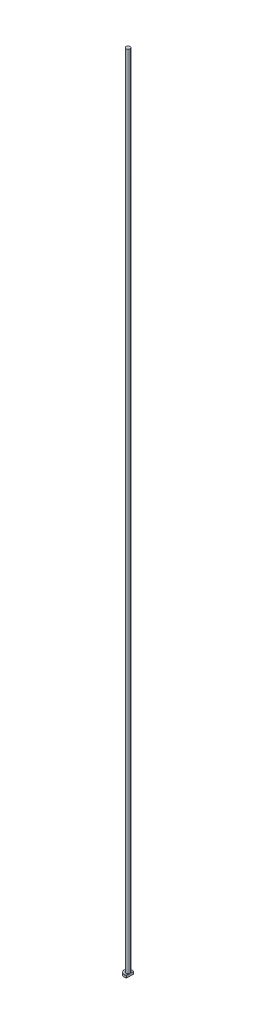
ISO-10303-21;
HEADER;
FILE_DESCRIPTION(('STEP AP214'),'2;1');
FILE_NAME('part.step','',(''),(''),'','','');
FILE_SCHEMA(('AUTOMOTIVE_DESIGN { 1 0 10303 214 1 1 1 1 }'));
ENDSEC;
DATA;
#1=APPLICATION_CONTEXT('core data for automotive mechanical design processes');
#2=APPLICATION_PROTOCOL_DEFINITION('international standard','automotive_design',2000,#1);
#3=PRODUCT_CONTEXT('',#1,'mechanical');
#4=PRODUCT('Part','Part','',(#3));
#5=PRODUCT_RELATED_PRODUCT_CATEGORY('part','',(#4));
#6=PRODUCT_DEFINITION_FORMATION('','',#4);
#7=PRODUCT_DEFINITION_CONTEXT('part definition',#1,'design');
#8=PRODUCT_DEFINITION('design','',#6,#7);
#9=PRODUCT_DEFINITION_SHAPE('','',#8);
#10=(LENGTH_UNIT() NAMED_UNIT(*) SI_UNIT(.MILLI.,.METRE.));
#11=(NAMED_UNIT(*) PLANE_ANGLE_UNIT() SI_UNIT($,.RADIAN.));
#12=(NAMED_UNIT(*) SI_UNIT($,.STERADIAN.) SOLID_ANGLE_UNIT());
#13=UNCERTAINTY_MEASURE_WITH_UNIT(LENGTH_MEASURE(1.E-05),#10,'distance_accuracy_value','');
#14=(GEOMETRIC_REPRESENTATION_CONTEXT(3) GLOBAL_UNCERTAINTY_ASSIGNED_CONTEXT((#13)) GLOBAL_UNIT_ASSIGNED_CONTEXT((#10,
#11,#12)) REPRESENTATION_CONTEXT('',''));
#15=CARTESIAN_POINT('',(0.,0.,0.));
#16=DIRECTION('',(0.,0.,1.));
#17=DIRECTION('',(1.,0.,0.));
#18=AXIS2_PLACEMENT_3D('',#15,#16,#17);
#19=CARTESIAN_POINT('',(0.,0.,0.));
#20=DIRECTION('',(0.,-1.,0.));
#21=DIRECTION('',(0.,0.,-1.));
#22=AXIS2_PLACEMENT_3D('',#19,#20,#21);
#23=PLANE('',#22);
#24=CARTESIAN_POINT('',(0.,0.,0.));
#25=DIRECTION('',(0.,-1.,0.));
#26=DIRECTION('',(0.,0.,-1.));
#27=AXIS2_PLACEMENT_3D('',#24,#25,#26);
#28=CIRCLE('',#27,4.7999999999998);
#29=CARTESIAN_POINT('',(2.49999999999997,0.,4.09756024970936));
#30=VERTEX_POINT('',#29);
#31=CARTESIAN_POINT('',(2.49999999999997,0.,-4.09756024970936));
#32=VERTEX_POINT('',#31);
#33=EDGE_CURVE('E98',#30,#32,#28,.T.);
#34=ORIENTED_EDGE('',*,*,#33,.T.);
#35=DIRECTION('',(0.,0.,1.));
#36=VECTOR('',#35,1.);
#37=CARTESIAN_POINT('',(2.49999999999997,0.,-4.33012701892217));
#38=LINE('',#37,#36);
#39=EDGE_CURVE('E83',#32,#30,#38,.T.);
#40=ORIENTED_EDGE('',*,*,#39,.T.);
#41=EDGE_LOOP('',(#34,#40));
#42=FACE_BOUND('',#41,.T.);
#43=ADVANCED_FACE('F32',(#42),#23,.T.);
#44=CARTESIAN_POINT('',(0.,259.958771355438,0.));
#45=DIRECTION('',(0.,1.,0.));
#46=DIRECTION('',(0.,0.,1.));
#47=AXIS2_PLACEMENT_3D('',#44,#45,#46);
#48=CYLINDRICAL_SURFACE('',#47,4.99999999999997);
#49=CARTESIAN_POINT('',(0.,2.80000000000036,0.));
#50=DIRECTION('',(0.,1.,0.));
#51=DIRECTION('',(0.,0.,1.));
#52=AXIS2_PLACEMENT_3D('',#49,#50,#51);
#53=CIRCLE('',#52,4.99999999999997);
#54=CARTESIAN_POINT('',(2.49999999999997,2.80000000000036,4.33012701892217));
#55=VERTEX_POINT('',#54);
#56=CARTESIAN_POINT('',(2.49999999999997,2.80000000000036,-4.33012701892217));
#57=VERTEX_POINT('',#56);
#58=EDGE_CURVE('E104',#55,#57,#53,.F.);
#59=ORIENTED_EDGE('',*,*,#58,.T.);
#60=DIRECTION('',(0.,-1.,0.));
#61=VECTOR('',#60,1.);
#62=CARTESIAN_POINT('',(2.49999999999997,1000.,-4.33012701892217));
#63=LINE('',#62,#61);
#64=CARTESIAN_POINT('',(2.49999999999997,0.200000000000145,-4.33012701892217));
#65=VERTEX_POINT('',#64);
#66=EDGE_CURVE('E183',#57,#65,#63,.T.);
#67=ORIENTED_EDGE('',*,*,#66,.T.);
#68=CARTESIAN_POINT('',(0.,0.200000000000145,0.));
#69=DIRECTION('',(0.,-1.,0.));
#70=DIRECTION('',(0.,0.,-1.));
#71=AXIS2_PLACEMENT_3D('',#68,#69,#70);
#72=CIRCLE('',#71,4.99999999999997);
#73=CARTESIAN_POINT('',(2.49999999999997,0.200000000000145,4.33012701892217));
#74=VERTEX_POINT('',#73);
#75=EDGE_CURVE('E100',#65,#74,#72,.F.);
#76=ORIENTED_EDGE('',*,*,#75,.T.);
#77=DIRECTION('',(0.,-1.,0.));
#78=VECTOR('',#77,1.);
#79=CARTESIAN_POINT('',(2.49999999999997,1000.,4.33012701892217));
#80=LINE('',#79,#78);
#81=EDGE_CURVE('E93',#55,#74,#80,.T.);
#82=ORIENTED_EDGE('',*,*,#81,.F.);
#83=EDGE_LOOP('',(#59,#67,#76,#82));
#84=FACE_BOUND('',#83,.T.);
#85=ADVANCED_FACE('F158',(#84),#48,.T.);
#86=CARTESIAN_POINT('',(-4.99999999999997,3.,0.));
#87=DIRECTION('',(0.,1.,0.));
#88=DIRECTION('',(0.,0.,1.));
#89=AXIS2_PLACEMENT_3D('',#86,#87,#88);
#90=PLANE('',#89);
#91=CARTESIAN_POINT('',(0.,3.,0.));
#92=DIRECTION('',(0.,1.,0.));
#93=DIRECTION('',(0.,0.,1.));
#94=AXIS2_PLACEMENT_3D('',#91,#92,#93);
#95=CIRCLE('',#94,4.80000000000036);
#96=CARTESIAN_POINT('',(2.49999999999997,3.,-4.09756024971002));
#97=VERTEX_POINT('',#96);
#98=CARTESIAN_POINT('',(2.49999999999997,3.,4.09756024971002));
#99=VERTEX_POINT('',#98);
#100=EDGE_CURVE('E178',#97,#99,#95,.T.);
#101=ORIENTED_EDGE('',*,*,#100,.T.);
#102=DIRECTION('',(0.,0.,-1.));
#103=VECTOR('',#102,1.);
#104=CARTESIAN_POINT('',(2.49999999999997,3.,0.));
#105=LINE('',#104,#103);
#106=CARTESIAN_POINT('',(2.49999999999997,2.99999999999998,1.01980390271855));
#107=VERTEX_POINT('',#106);
#108=EDGE_CURVE('E57',#99,#107,#105,.T.);
#109=ORIENTED_EDGE('',*,*,#108,.T.);
#110=CARTESIAN_POINT('',(0.,3.,0.));
#111=DIRECTION('',(0.,1.,0.));
#112=DIRECTION('',(0.,0.,1.));
#113=AXIS2_PLACEMENT_3D('',#110,#111,#112);
#114=CIRCLE('',#113,2.69999999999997);
#115=CARTESIAN_POINT('',(2.49999999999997,2.99999999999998,-1.01980390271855));
#116=VERTEX_POINT('',#115);
#117=EDGE_CURVE('E107',#107,#116,#114,.F.);
#118=ORIENTED_EDGE('',*,*,#117,.T.);
#119=EDGE_CURVE('E136',#116,#97,#105,.T.);
#120=ORIENTED_EDGE('',*,*,#119,.T.);
#121=EDGE_LOOP('',(#101,#109,#118,#120));
#122=FACE_BOUND('',#121,.T.);
#123=ADVANCED_FACE('F147',(#122),#90,.T.);
#124=CARTESIAN_POINT('',(0.,3.,0.));
#125=DIRECTION('',(0.,-1.,0.));
#126=DIRECTION('',(0.,0.,-1.));
#127=AXIS2_PLACEMENT_3D('',#124,#125,#126);
#128=CONICAL_SURFACE('',#127,4.80000000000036,0.785398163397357);
#129=ORIENTED_EDGE('',*,*,#58,.F.);
#130=CARTESIAN_POINT('',(2.49999999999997,-2.05039133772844,9.527864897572));
#131=CARTESIAN_POINT('',(2.49999999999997,-1.84160367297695,9.31199733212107));
#132=CARTESIAN_POINT('',(2.49999999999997,-1.63304008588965,9.0959123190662));
#133=CARTESIAN_POINT('',(2.49999999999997,-1.21649358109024,8.66317810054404));
#134=CARTESIAN_POINT('',(2.49999999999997,-1.00851067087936,8.44652888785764));
#135=CARTESIAN_POINT('',(2.49999999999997,-0.593157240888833,8.01243155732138));
#136=CARTESIAN_POINT('',(2.49999999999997,-0.385787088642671,7.79498308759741));
#137=CARTESIAN_POINT('',(2.49999999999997,0.0280365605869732,7.35921771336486));
#138=CARTESIAN_POINT('',(2.49999999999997,0.23449006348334,7.1409008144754));
#139=CARTESIAN_POINT('',(2.49999999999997,0.642130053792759,6.70748960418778));
#140=CARTESIAN_POINT('',(2.49999999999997,0.843339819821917,6.49241720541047));
#141=CARTESIAN_POINT('',(2.49999999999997,1.24425381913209,6.06087422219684));
#142=CARTESIAN_POINT('',(2.49999999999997,1.44395806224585,5.84440364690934));
#143=CARTESIAN_POINT('',(2.49999999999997,1.841277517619,5.4096366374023));
#144=CARTESIAN_POINT('',(2.49999999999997,2.03889317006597,5.1913406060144));
#145=CARTESIAN_POINT('',(2.49999999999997,2.43125043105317,4.75218509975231));
#146=CARTESIAN_POINT('',(2.49999999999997,2.62599215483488,4.53132572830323));
#147=CARTESIAN_POINT('',(2.49999999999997,2.93693788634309,4.17181619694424));
#148=CARTESIAN_POINT('',(2.49999999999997,3.05446493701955,4.0343118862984));
#149=CARTESIAN_POINT('',(2.49999999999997,3.2874270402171,3.75751486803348));
#150=CARTESIAN_POINT('',(2.49999999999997,3.40286188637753,3.61822198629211));
#151=CARTESIAN_POINT('',(2.49999999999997,3.63213234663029,3.33586492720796));
#152=CARTESIAN_POINT('',(2.49999999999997,3.74593818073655,3.1927764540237));
#153=CARTESIAN_POINT('',(2.49999999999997,3.96956266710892,2.90356071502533));
#154=CARTESIAN_POINT('',(2.49999999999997,4.07938227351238,2.75743418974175));
#155=CARTESIAN_POINT('',(2.49999999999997,4.29502410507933,2.45881038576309));
#156=CARTESIAN_POINT('',(2.49999999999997,4.40076032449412,2.3062500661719));
#157=CARTESIAN_POINT('',(2.49999999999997,4.55286945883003,2.07299325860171));
#158=CARTESIAN_POINT('',(2.49999999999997,4.60252613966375,1.99444197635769));
#159=CARTESIAN_POINT('',(2.49999999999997,4.69908164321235,1.83566827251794));
#160=CARTESIAN_POINT('',(2.49999999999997,4.74598077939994,1.75544604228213));
#161=CARTESIAN_POINT('',(2.49999999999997,4.83578466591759,1.59405362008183));
#162=CARTESIAN_POINT('',(2.49999999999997,4.87873126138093,1.51290702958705));
#163=CARTESIAN_POINT('',(2.49999999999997,4.96038600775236,1.34852090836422));
#164=CARTESIAN_POINT('',(2.49999999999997,4.99909338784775,1.26528100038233));
#165=CARTESIAN_POINT('',(2.49999999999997,5.10703093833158,1.01251774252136));
#166=CARTESIAN_POINT('',(2.49999999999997,5.16843307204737,0.839342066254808));
#167=CARTESIAN_POINT('',(2.49999999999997,5.23490554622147,0.579703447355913));
#168=CARTESIAN_POINT('',(2.49999999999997,5.25253806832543,0.496421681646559));
#169=CARTESIAN_POINT('',(2.49999999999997,5.27986337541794,0.328535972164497));
#170=CARTESIAN_POINT('',(2.49999999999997,5.28955686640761,0.243932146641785));
#171=CARTESIAN_POINT('',(2.49999999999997,5.30031768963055,0.0744340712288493));
#172=CARTESIAN_POINT('',(2.49999999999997,5.30141176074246,-0.0104584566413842));
#173=CARTESIAN_POINT('',(2.49999999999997,5.294965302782,-0.179916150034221));
#174=CARTESIAN_POINT('',(2.49999999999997,5.28742406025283,-0.264481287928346));
#175=CARTESIAN_POINT('',(2.49999999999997,5.26433424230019,-0.431754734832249));
#176=CARTESIAN_POINT('',(2.49999999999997,5.24885436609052,-0.514472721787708));
#177=CARTESIAN_POINT('',(2.49999999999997,5.21085318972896,-0.678257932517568));
#178=CARTESIAN_POINT('',(2.49999999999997,5.18833104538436,-0.759324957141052));
#179=CARTESIAN_POINT('',(2.49999999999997,5.1371892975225,-0.920001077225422));
#180=CARTESIAN_POINT('',(2.49999999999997,5.1085353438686,-0.999599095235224));
#181=CARTESIAN_POINT('',(2.49999999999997,5.04628092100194,-1.15679278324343));
#182=CARTESIAN_POINT('',(2.49999999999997,5.01268146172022,-1.23438885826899));
#183=CARTESIAN_POINT('',(2.49999999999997,4.90558195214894,-1.46503672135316));
#184=CARTESIAN_POINT('',(2.49999999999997,4.82601567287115,-1.61526350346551));
#185=CARTESIAN_POINT('',(2.49999999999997,4.65635232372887,-1.90970759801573));
#186=CARTESIAN_POINT('',(2.49999999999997,4.56624199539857,-2.0539170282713));
#187=CARTESIAN_POINT('',(2.49999999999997,4.37862201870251,-2.33821627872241));
#188=CARTESIAN_POINT('',(2.49999999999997,4.28108460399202,-2.47828761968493));
#189=CARTESIAN_POINT('',(2.49999999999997,4.08116271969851,-2.75478641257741));
#190=CARTESIAN_POINT('',(2.49999999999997,3.97878070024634,-2.89121565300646));
#191=CARTESIAN_POINT('',(2.49999999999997,3.7691391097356,-3.16313520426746));
#192=CARTESIAN_POINT('',(2.49999999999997,3.66183307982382,-3.29858952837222));
#193=CARTESIAN_POINT('',(2.49999999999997,3.44456217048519,-3.56736427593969));
#194=CARTESIAN_POINT('',(2.49999999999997,3.33459700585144,-3.70068446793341));
#195=CARTESIAN_POINT('',(2.49999999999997,3.1129346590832,-3.96532340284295));
#196=CARTESIAN_POINT('',(2.49999999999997,3.00124232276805,-4.09664621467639));
#197=CARTESIAN_POINT('',(2.49999999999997,2.7763127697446,-4.35796341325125));
#198=CARTESIAN_POINT('',(2.49999999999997,2.66307552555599,-4.48795777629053));
#199=CARTESIAN_POINT('',(2.49999999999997,2.36028773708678,-4.83228553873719));
#200=CARTESIAN_POINT('',(2.49999999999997,2.16967435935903,-5.04568363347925));
#201=CARTESIAN_POINT('',(2.49999999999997,1.78611780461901,-5.4703791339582));
#202=CARTESIAN_POINT('',(2.49999999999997,1.59317456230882,-5.68167648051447));
#203=CARTESIAN_POINT('',(2.49999999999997,1.20540648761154,-6.1029035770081));
#204=CARTESIAN_POINT('',(2.49999999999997,1.01058005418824,-6.31283185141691));
#205=CARTESIAN_POINT('',(2.49999999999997,0.619649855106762,-6.73149551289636));
#206=CARTESIAN_POINT('',(2.49999999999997,0.423546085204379,-6.94023089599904));
#207=CARTESIAN_POINT('',(2.49999999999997,0.0384434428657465,-7.34820392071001));
#208=CARTESIAN_POINT('',(2.49999999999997,-0.150515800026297,-7.5474789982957));
#209=CARTESIAN_POINT('',(2.49999999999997,-0.529153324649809,-7.94534601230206));
#210=CARTESIAN_POINT('',(2.49999999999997,-0.718831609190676,-8.14393794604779));
#211=CARTESIAN_POINT('',(2.49999999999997,-1.09855461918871,-8.54034636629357));
#212=CARTESIAN_POINT('',(2.49999999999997,-1.28859869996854,-8.73816347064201));
#213=CARTESIAN_POINT('',(2.49999999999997,-1.66916268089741,-9.13333639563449));
#214=CARTESIAN_POINT('',(2.49999999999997,-1.85968257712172,-9.33069222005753));
#215=CARTESIAN_POINT('',(2.49999999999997,-2.05039133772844,-9.527864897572));
#216=B_SPLINE_CURVE_WITH_KNOTS('',3,(#130,#131,#132,#133,#134,#135,#136,#137,#138,#139,#140,
#141,#142,#143,#144,#145,#146,#147,#148,#149,#150,#151,#152,#153,#154,#155,#156,#157,#158,#159,
#160,#161,#162,#163,#164,#165,#166,#167,#168,#169,#170,#171,#172,#173,#174,#175,#176,#177,#178,
#179,#180,#181,#182,#183,#184,#185,#186,#187,#188,#189,#190,#191,#192,#193,#194,#195,#196,#197,
#198,#199,#200,#201,#202,#203,#204,#205,#206,#207,#208,#209,#210,#211,#212,#213,#214,#215),
.UNSPECIFIED.,.F.,.F.,(4,2,2,2,2,2,2,2,2,2,2,2,2,2,2,2,2,2,2,2,2,2,2,2,2,2,2,2,2,2,2,2,2,2,2,2,
2,2,2,2,2,2,4),(0.,0.900955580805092,1.8019227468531,2.70335062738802,3.60477268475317,
4.48832484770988,5.37187123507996,6.25522753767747,7.13854832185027,7.68119321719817,
8.22389134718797,8.77232299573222,9.32062249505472,9.87724663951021,10.1559936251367,
10.4347088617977,10.7100145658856,10.9853702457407,11.5339745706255,11.789046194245,
12.0440951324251,12.298350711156,12.5526272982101,12.8047396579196,13.0568822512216,
13.3104761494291,13.5640183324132,14.0732618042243,14.5831526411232,15.0950533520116,
15.6066978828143,16.1250759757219,16.6435099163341,17.1606868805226,17.6778730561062,
18.5362451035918,19.3946412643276,20.2538459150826,21.1130534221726,21.9369112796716,
22.7607723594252,23.5837145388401,24.4066499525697),.UNSPECIFIED.);
#217=EDGE_CURVE('E135',#55,#99,#216,.T.);
#218=ORIENTED_EDGE('',*,*,#217,.T.);
#219=ORIENTED_EDGE('',*,*,#100,.F.);
#220=EDGE_CURVE('E127',#97,#57,#216,.T.);
#221=ORIENTED_EDGE('',*,*,#220,.T.);
#222=EDGE_LOOP('',(#129,#218,#219,#221));
#223=FACE_BOUND('',#222,.T.);
#224=ADVANCED_FACE('F143',(#223),#128,.T.);
#225=CARTESIAN_POINT('',(0.,0.200000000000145,0.));
#226=DIRECTION('',(0.,1.,0.));
#227=DIRECTION('',(0.,0.,1.));
#228=AXIS2_PLACEMENT_3D('',#225,#226,#227);
#229=CONICAL_SURFACE('',#228,4.99999999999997,0.785398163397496);
#230=ORIENTED_EDGE('',*,*,#75,.F.);
#231=CARTESIAN_POINT('',(2.49999999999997,5.05039133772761,-9.52786489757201));
#232=CARTESIAN_POINT('',(2.49999999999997,4.84160367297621,-9.31199733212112));
#233=CARTESIAN_POINT('',(2.49999999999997,4.63304008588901,-9.09591231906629));
#234=CARTESIAN_POINT('',(2.49999999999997,4.2164935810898,-8.66317810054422));
#235=CARTESIAN_POINT('',(2.49999999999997,4.00851067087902,-8.44652888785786));
#236=CARTESIAN_POINT('',(2.49999999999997,3.59315724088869,-8.01243155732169));
#237=CARTESIAN_POINT('',(2.49999999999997,3.38578708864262,-7.79498308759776));
#238=CARTESIAN_POINT('',(2.49999999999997,2.97196343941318,-7.3592177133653));
#239=CARTESIAN_POINT('',(2.49999999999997,2.76550993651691,-7.14090081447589));
#240=CARTESIAN_POINT('',(2.49999999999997,2.35786994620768,-6.70748960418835));
#241=CARTESIAN_POINT('',(2.49999999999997,2.15666018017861,-6.49241720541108));
#242=CARTESIAN_POINT('',(2.49999999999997,1.75574618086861,-6.06087422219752));
#243=CARTESIAN_POINT('',(2.49999999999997,1.55604193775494,-5.84440364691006));
#244=CARTESIAN_POINT('',(2.49999999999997,1.15872248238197,-5.40963663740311));
#245=CARTESIAN_POINT('',(2.49999999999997,0.961106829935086,-5.19134060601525));
#246=CARTESIAN_POINT('',(2.49999999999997,0.568749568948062,-4.75218509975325));
#247=CARTESIAN_POINT('',(2.49999999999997,0.374007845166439,-4.53132572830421));
#248=CARTESIAN_POINT('',(2.49999999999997,0.063062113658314,-4.17181619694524));
#249=CARTESIAN_POINT('',(2.49999999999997,-0.0544649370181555,-4.03431188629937));
#250=CARTESIAN_POINT('',(2.49999999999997,-0.287427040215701,-3.75751486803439));
#251=CARTESIAN_POINT('',(2.49999999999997,-0.402861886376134,-3.61822198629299));
#252=CARTESIAN_POINT('',(2.49999999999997,-0.632132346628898,-3.33586492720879));
#253=CARTESIAN_POINT('',(2.49999999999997,-0.745938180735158,-3.19277645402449));
#254=CARTESIAN_POINT('',(2.49999999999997,-0.969562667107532,-2.90356071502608));
#255=CARTESIAN_POINT('',(2.49999999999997,-1.07938227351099,-2.75743418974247));
#256=CARTESIAN_POINT('',(2.49999999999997,-1.29502410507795,-2.45881038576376));
#257=CARTESIAN_POINT('',(2.49999999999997,-1.40076032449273,-2.30625006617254));
#258=CARTESIAN_POINT('',(2.49999999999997,-1.55286945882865,-2.07299325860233));
#259=CARTESIAN_POINT('',(2.49999999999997,-1.60252613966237,-1.99444197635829));
#260=CARTESIAN_POINT('',(2.49999999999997,-1.69908164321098,-1.83566827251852));
#261=CARTESIAN_POINT('',(2.49999999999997,-1.74598077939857,-1.75544604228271));
#262=CARTESIAN_POINT('',(2.49999999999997,-1.83578466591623,-1.59405362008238));
#263=CARTESIAN_POINT('',(2.49999999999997,-1.87873126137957,-1.5129070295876));
#264=CARTESIAN_POINT('',(2.49999999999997,-1.96038600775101,-1.34852090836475));
#265=CARTESIAN_POINT('',(2.49999999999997,-1.99909338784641,-1.26528100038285));
#266=CARTESIAN_POINT('',(2.49999999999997,-2.10703093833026,-1.01251774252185));
#267=CARTESIAN_POINT('',(2.49999999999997,-2.16843307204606,-0.839342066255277));
#268=CARTESIAN_POINT('',(2.49999999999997,-2.2349055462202,-0.579703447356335));
#269=CARTESIAN_POINT('',(2.49999999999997,-2.25253806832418,-0.496421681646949));
#270=CARTESIAN_POINT('',(2.49999999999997,-2.27986337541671,-0.328535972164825));
#271=CARTESIAN_POINT('',(2.49999999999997,-2.28955686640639,-0.243932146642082));
#272=CARTESIAN_POINT('',(2.49999999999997,-2.30031768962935,-0.0744340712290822));
#273=CARTESIAN_POINT('',(2.49999999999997,-2.30141176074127,0.0104584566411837));
#274=CARTESIAN_POINT('',(2.49999999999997,-2.29496530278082,0.179916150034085));
#275=CARTESIAN_POINT('',(2.49999999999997,-2.28742406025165,0.264481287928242));
#276=CARTESIAN_POINT('',(2.49999999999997,-2.26433424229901,0.43175473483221));
#277=CARTESIAN_POINT('',(2.49999999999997,-2.24885436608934,0.514472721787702));
#278=CARTESIAN_POINT('',(2.49999999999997,-2.21085318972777,0.678257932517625));
#279=CARTESIAN_POINT('',(2.49999999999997,-2.18833104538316,0.759324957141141));
#280=CARTESIAN_POINT('',(2.49999999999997,-2.13718929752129,0.920001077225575));
#281=CARTESIAN_POINT('',(2.49999999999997,-2.10853534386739,0.999599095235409));
#282=CARTESIAN_POINT('',(2.49999999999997,-2.04628092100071,1.15679278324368));
#283=CARTESIAN_POINT('',(2.49999999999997,-2.01268146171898,1.23438885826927));
#284=CARTESIAN_POINT('',(2.49999999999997,-1.90558195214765,1.46503672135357));
#285=CARTESIAN_POINT('',(2.49999999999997,-1.82601567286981,1.61526350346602));
#286=CARTESIAN_POINT('',(2.49999999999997,-1.65635232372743,1.90970759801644));
#287=CARTESIAN_POINT('',(2.49999999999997,-1.56624199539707,2.05391702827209));
#288=CARTESIAN_POINT('',(2.49999999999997,-1.3786220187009,2.33821627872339));
#289=CARTESIAN_POINT('',(2.49999999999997,-1.28108460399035,2.478287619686));
#290=CARTESIAN_POINT('',(2.49999999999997,-1.08116271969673,2.75478641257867));
#291=CARTESIAN_POINT('',(2.49999999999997,-0.978780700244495,2.89121565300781));
#292=CARTESIAN_POINT('',(2.49999999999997,-0.76913910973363,3.16313520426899));
#293=CARTESIAN_POINT('',(2.49999999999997,-0.661833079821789,3.29858952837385));
#294=CARTESIAN_POINT('',(2.49999999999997,-0.444562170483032,3.5673642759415));
#295=CARTESIAN_POINT('',(2.49999999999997,-0.334597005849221,3.7006844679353));
#296=CARTESIAN_POINT('',(2.49999999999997,-0.112934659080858,3.96532340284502));
#297=CARTESIAN_POINT('',(2.49999999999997,-0.00124232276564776,4.09664621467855));
#298=CARTESIAN_POINT('',(2.49999999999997,0.223687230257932,4.35796341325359));
#299=CARTESIAN_POINT('',(2.49999999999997,0.336924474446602,4.48795777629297));
#300=CARTESIAN_POINT('',(2.49999999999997,0.639712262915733,4.83228553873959));
#301=CARTESIAN_POINT('',(2.49999999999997,0.83032564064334,5.04568363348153));
#302=CARTESIAN_POINT('',(2.49999999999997,1.21388219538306,5.47037913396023));
#303=CARTESIAN_POINT('',(2.49999999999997,1.4068254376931,5.68167648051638));
#304=CARTESIAN_POINT('',(2.49999999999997,1.79459351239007,6.10290357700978));
#305=CARTESIAN_POINT('',(2.49999999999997,1.98941994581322,6.31283185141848));
#306=CARTESIAN_POINT('',(2.49999999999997,2.38035014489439,6.73149551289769));
#307=CARTESIAN_POINT('',(2.49999999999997,2.57645391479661,6.94023089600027));
#308=CARTESIAN_POINT('',(2.49999999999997,2.96155655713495,7.34820392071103));
#309=CARTESIAN_POINT('',(2.49999999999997,3.15051580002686,7.54747899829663));
#310=CARTESIAN_POINT('',(2.49999999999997,3.52915332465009,7.9453460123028));
#311=CARTESIAN_POINT('',(2.49999999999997,3.71883160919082,8.14393794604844));
#312=CARTESIAN_POINT('',(2.49999999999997,4.09855461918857,8.54034636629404));
#313=CARTESIAN_POINT('',(2.49999999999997,4.28859869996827,8.73816347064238));
#314=CARTESIAN_POINT('',(2.49999999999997,4.66916268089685,9.13333639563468));
#315=CARTESIAN_POINT('',(2.49999999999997,4.85968257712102,9.33069222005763));
#316=CARTESIAN_POINT('',(2.49999999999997,5.05039133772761,9.52786489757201));
#317=B_SPLINE_CURVE_WITH_KNOTS('',3,(#231,#232,#233,#234,#235,#236,#237,#238,#239,#240,#241,
#242,#243,#244,#245,#246,#247,#248,#249,#250,#251,#252,#253,#254,#255,#256,#257,#258,#259,#260,
#261,#262,#263,#264,#265,#266,#267,#268,#269,#270,#271,#272,#273,#274,#275,#276,#277,#278,#279,
#280,#281,#282,#283,#284,#285,#286,#287,#288,#289,#290,#291,#292,#293,#294,#295,#296,#297,#298,
#299,#300,#301,#302,#303,#304,#305,#306,#307,#308,#309,#310,#311,#312,#313,#314,#315,#316),
.UNSPECIFIED.,.F.,.F.,(4,2,2,2,2,2,2,2,2,2,2,2,2,2,2,2,2,2,2,2,2,2,2,2,2,2,2,2,2,2,2,2,2,2,2,2,
2,2,2,2,2,2,4),(0.,0.900955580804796,1.8019227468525,2.70335062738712,3.60477268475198,
4.48832484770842,5.37187123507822,6.25522753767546,7.13854832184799,7.68119321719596,
8.22389134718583,8.77232299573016,9.32062249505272,9.87724663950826,10.1559936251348,
10.4347088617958,10.7100145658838,10.9853702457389,11.5339745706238,11.7890461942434,
12.0440951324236,12.2983507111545,12.5526272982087,12.8047396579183,13.0568822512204,
13.310476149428,13.5640183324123,14.0732618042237,14.5831526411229,15.0950533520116,
15.6066978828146,16.1250759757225,16.6435099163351,17.1606868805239,17.6778730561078,
18.5362451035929,19.3946412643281,20.2538459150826,21.113053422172,21.9369112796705,
22.7607723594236,23.583714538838,24.4066499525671),.UNSPECIFIED.);
#318=EDGE_CURVE('E86',#65,#32,#317,.T.);
#319=ORIENTED_EDGE('',*,*,#318,.T.);
#320=ORIENTED_EDGE('',*,*,#33,.F.);
#321=EDGE_CURVE('E89',#30,#74,#317,.T.);
#322=ORIENTED_EDGE('',*,*,#321,.T.);
#323=EDGE_LOOP('',(#230,#319,#320,#322));
#324=FACE_BOUND('',#323,.T.);
#325=ADVANCED_FACE('F97',(#324),#229,.T.);
#326=CARTESIAN_POINT('',(0.,3.19999999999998,0.));
#327=DIRECTION('',(0.,1.,0.));
#328=DIRECTION('',(0.,0.,1.));
#329=AXIS2_PLACEMENT_3D('',#326,#327,#328);
#330=TOROIDAL_SURFACE('',#329,2.69999999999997,0.2);
#331=CARTESIAN_POINT('',(2.49999999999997,3.19999999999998,0.));
#332=CARTESIAN_POINT('',(2.49999999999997,3.20000050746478,5.29061312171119E-11));
#333=CARTESIAN_POINT('',(2.49999999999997,3.20000101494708,-1.70517157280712E-07));
#334=CARTESIAN_POINT('',(2.49999999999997,3.20000196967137,-6.59443804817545E-07));
#335=CARTESIAN_POINT('',(2.49999999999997,3.20000240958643,-9.87883924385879E-07));
#336=CARTESIAN_POINT('',(2.49999999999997,3.20000331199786,-1.7724689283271E-06));
#337=CARTESIAN_POINT('',(2.49999999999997,3.20000376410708,-2.24097229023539E-06));
#338=CARTESIAN_POINT('',(2.49999999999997,3.20000458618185,-3.2218605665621E-06));
#339=CARTESIAN_POINT('',(2.49999999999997,3.20000495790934,-3.73286586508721E-06));
#340=CARTESIAN_POINT('',(2.49999999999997,3.20000630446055,-5.67453781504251E-06));
#341=CARTESIAN_POINT('',(2.49999999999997,3.20000720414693,-7.15943624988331E-06));
#342=CARTESIAN_POINT('',(2.49999999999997,3.20000871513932,-1.01304383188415E-05));
#343=CARTESIAN_POINT('',(2.49999999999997,3.20000934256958,-1.16087237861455E-05));
#344=CARTESIAN_POINT('',(2.49999999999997,3.20001191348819,-1.77555555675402E-05));
#345=CARTESIAN_POINT('',(2.49999999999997,3.20001378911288,-2.24564506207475E-05));
#346=CARTESIAN_POINT('',(2.49999999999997,3.20001661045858,-3.14167101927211E-05));
#347=CARTESIAN_POINT('',(2.49999999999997,3.20001764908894,-3.56468503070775E-05));
#348=CARTESIAN_POINT('',(2.49999999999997,3.20002511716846,-6.67543462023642E-05));
#349=CARTESIAN_POINT('',(2.49999999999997,3.20003067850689,-9.37930225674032E-05));
#350=CARTESIAN_POINT('',(2.49999999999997,3.20005501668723,-0.000200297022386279));
#351=CARTESIAN_POINT('',(2.49999999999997,3.20007833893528,-0.000278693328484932));
#352=CARTESIAN_POINT('',(2.49999999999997,3.20016883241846,-0.000588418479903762));
#353=CARTESIAN_POINT('',(2.49999999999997,3.2002329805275,-0.000820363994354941));
#354=CARTESIAN_POINT('',(2.49999999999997,3.20048923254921,-0.00173961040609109));
#355=CARTESIAN_POINT('',(2.49999999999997,3.20068508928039,-0.00242612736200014));
#356=CARTESIAN_POINT('',(2.49999999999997,3.201497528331,-0.00528196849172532));
#357=CARTESIAN_POINT('',(2.49999999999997,3.20210941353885,-0.0074522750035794));
#358=CARTESIAN_POINT('',(2.49999999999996,3.20774599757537,-0.0274346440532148));
#359=CARTESIAN_POINT('',(2.49999999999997,3.21279017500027,-0.0452427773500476));
#360=CARTESIAN_POINT('',(2.49999999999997,3.22264347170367,-0.080167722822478));
#361=CARTESIAN_POINT('',(2.49999999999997,3.22745402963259,-0.0972841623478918));
#362=CARTESIAN_POINT('',(2.49999999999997,3.23763483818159,-0.133672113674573));
#363=CARTESIAN_POINT('',(2.49999999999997,3.24299975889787,-0.15294514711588));
#364=CARTESIAN_POINT('',(2.49999999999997,3.25370389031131,-0.191722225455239));
#365=CARTESIAN_POINT('',(2.49999999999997,3.25904219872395,-0.211226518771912));
#366=CARTESIAN_POINT('',(2.49999999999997,3.27184445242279,-0.258540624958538));
#367=CARTESIAN_POINT('',(2.49999999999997,3.27925018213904,-0.286366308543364));
#368=CARTESIAN_POINT('',(2.49999999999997,3.29355148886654,-0.341371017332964));
#369=CARTESIAN_POINT('',(2.49999999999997,3.30045534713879,-0.368547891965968));
#370=CARTESIAN_POINT('',(2.49999999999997,3.31991129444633,-0.447507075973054));
#371=CARTESIAN_POINT('',(2.49999999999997,3.33195369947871,-0.499417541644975));
#372=CARTESIAN_POINT('',(2.49999999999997,3.35404241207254,-0.60418810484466));
#373=CARTESIAN_POINT('',(2.49999999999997,3.36406867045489,-0.657052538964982));
#374=CARTESIAN_POINT('',(2.49999999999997,3.38176575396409,-0.767598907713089));
#375=CARTESIAN_POINT('',(2.49999999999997,3.38917909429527,-0.825323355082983));
#376=CARTESIAN_POINT('',(2.49999999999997,3.39884096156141,-0.94105511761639));
#377=CARTESIAN_POINT('',(2.49999999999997,3.40111055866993,-0.999060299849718));
#378=CARTESIAN_POINT('',(2.49999999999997,3.39847691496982,-1.09324578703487));
#379=CARTESIAN_POINT('',(2.49999999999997,3.39593644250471,-1.12948454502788));
#380=CARTESIAN_POINT('',(2.49999999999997,3.38674319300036,-1.20096926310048));
#381=CARTESIAN_POINT('',(2.49999999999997,3.38015410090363,-1.2362219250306));
#382=CARTESIAN_POINT('',(2.49999999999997,3.36639936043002,-1.28579148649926));
#383=CARTESIAN_POINT('',(2.49999999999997,3.36162670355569,-1.30076836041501));
#384=CARTESIAN_POINT('',(2.49999999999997,3.35062798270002,-1.33028325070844));
#385=CARTESIAN_POINT('',(2.49999999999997,3.34439458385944,-1.34481861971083));
#386=CARTESIAN_POINT('',(2.49999999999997,3.33003808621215,-1.37319413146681));
#387=CARTESIAN_POINT('',(2.49999999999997,3.32189015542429,-1.38702194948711));
#388=CARTESIAN_POINT('',(2.49999999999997,3.30325367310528,-1.4129811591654));
#389=CARTESIAN_POINT('',(2.49999999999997,3.2927824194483,-1.42512406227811));
#390=CARTESIAN_POINT('',(2.49999999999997,3.27569207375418,-1.44029611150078));
#391=CARTESIAN_POINT('',(2.49999999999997,3.27021837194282,-1.4446101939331));
#392=CARTESIAN_POINT('',(2.49999999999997,3.25870897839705,-1.45242709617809));
#393=CARTESIAN_POINT('',(2.49999999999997,3.25267333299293,-1.45592998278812));
#394=CARTESIAN_POINT('',(2.49999999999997,3.24001938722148,-1.46191450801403));
#395=CARTESIAN_POINT('',(2.49999999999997,3.233395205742,-1.46438399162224));
#396=CARTESIAN_POINT('',(2.49999999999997,3.21979347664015,-1.46798853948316));
#397=CARTESIAN_POINT('',(2.49999999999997,3.21281651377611,-1.46912574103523));
#398=CARTESIAN_POINT('',(2.49999999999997,3.19961348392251,-1.46988240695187));
#399=CARTESIAN_POINT('',(2.49999999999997,3.19339654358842,-1.46966594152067));
#400=CARTESIAN_POINT('',(2.49999999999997,3.18110362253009,-1.46811597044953));
#401=CARTESIAN_POINT('',(2.49999999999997,3.17502769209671,-1.46678207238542));
#402=CARTESIAN_POINT('',(2.49999999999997,3.16354702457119,-1.46323301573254));
#403=CARTESIAN_POINT('',(2.49999999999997,3.15812390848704,-1.46107586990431));
#404=CARTESIAN_POINT('',(2.49999999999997,3.14763458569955,-1.45603007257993));
#405=CARTESIAN_POINT('',(2.49999999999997,3.14256845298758,-1.45314127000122));
#406=CARTESIAN_POINT('',(2.49999999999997,3.12963191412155,-1.44468844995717));
#407=CARTESIAN_POINT('',(2.49999999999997,3.12209714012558,-1.43861122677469));
#408=CARTESIAN_POINT('',(2.49999999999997,3.10805350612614,-1.42536327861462));
#409=CARTESIAN_POINT('',(2.49999999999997,3.10154826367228,-1.418188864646));
#410=CARTESIAN_POINT('',(2.49999999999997,3.08513615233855,-1.39772885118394));
#411=CARTESIAN_POINT('',(2.49999999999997,3.07611692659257,-1.38373739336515));
#412=CARTESIAN_POINT('',(2.49999999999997,3.06018433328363,-1.35465370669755));
#413=CARTESIAN_POINT('',(2.49999999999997,3.0532724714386,-1.33956070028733));
#414=CARTESIAN_POINT('',(2.49999999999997,3.04107204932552,-1.30868385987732));
#415=CARTESIAN_POINT('',(2.49999999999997,3.03578911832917,-1.29289784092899));
#416=CARTESIAN_POINT('',(2.49999999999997,3.02655583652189,-1.26093375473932));
#417=CARTESIAN_POINT('',(2.49999999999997,3.0226069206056,-1.24475528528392));
#418=CARTESIAN_POINT('',(2.49999999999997,3.01232854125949,-1.19551094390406));
#419=CARTESIAN_POINT('',(2.49999999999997,3.00769429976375,-1.16209442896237));
#420=CARTESIAN_POINT('',(2.49999999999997,3.00005311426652,-1.07761506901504));
#421=CARTESIAN_POINT('',(2.49999999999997,2.99913690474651,-1.02638928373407));
#422=CARTESIAN_POINT('',(2.49999999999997,3.00223345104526,-0.923947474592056));
#423=CARTESIAN_POINT('',(2.49999999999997,3.00626667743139,-0.872732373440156));
#424=CARTESIAN_POINT('',(2.49999999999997,3.01749958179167,-0.773934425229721));
#425=CARTESIAN_POINT('',(2.49999999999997,3.02448410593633,-0.72632575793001));
#426=CARTESIAN_POINT('',(2.49999999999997,3.04066526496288,-0.631906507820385));
#427=CARTESIAN_POINT('',(2.49999999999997,3.0498429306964,-0.585092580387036));
#428=CARTESIAN_POINT('',(2.49999999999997,3.06791405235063,-0.500780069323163));
#429=CARTESIAN_POINT('',(2.49999999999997,3.07652349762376,-0.463219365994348));
#430=CARTESIAN_POINT('',(2.49999999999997,3.09478102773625,-0.387318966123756));
#431=CARTESIAN_POINT('',(2.49999999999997,3.10445029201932,-0.348984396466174));
#432=CARTESIAN_POINT('',(2.49999999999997,3.12135487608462,-0.284095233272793));
#433=CARTESIAN_POINT('',(2.49999999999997,3.12843710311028,-0.257500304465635));
#434=CARTESIAN_POINT('',(2.49999999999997,3.14273562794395,-0.204655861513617));
#435=CARTESIAN_POINT('',(2.49999999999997,3.1499496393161,-0.178405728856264));
#436=CARTESIAN_POINT('',(2.49999999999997,3.1636921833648,-0.128877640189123));
#437=CARTESIAN_POINT('',(2.49999999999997,3.17020707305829,-0.10559584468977));
#438=CARTESIAN_POINT('',(2.49999999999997,3.18358099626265,-0.0580847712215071));
#439=CARTESIAN_POINT('',(2.49999999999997,3.19044308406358,-0.033856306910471));
#440=CARTESIAN_POINT('',(2.49999999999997,3.19789108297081,-0.00745034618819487));
#441=CARTESIAN_POINT('',(2.49999999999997,3.198503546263,-0.00527812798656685));
#442=CARTESIAN_POINT('',(2.49999999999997,3.1993161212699,-0.0024218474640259));
#443=CARTESIAN_POINT('',(2.49999999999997,3.19951155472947,-0.00173680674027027));
#444=CARTESIAN_POINT('',(2.49999999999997,3.19976729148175,-0.000819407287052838));
#445=CARTESIAN_POINT('',(2.49999999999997,3.19983133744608,-0.00058783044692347));
#446=CARTESIAN_POINT('',(2.49999999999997,3.19992170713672,-0.000278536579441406));
#447=CARTESIAN_POINT('',(2.49999999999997,3.19994501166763,-0.000200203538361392));
#448=CARTESIAN_POINT('',(2.49999999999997,3.19996933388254,-9.3772760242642E-05));
#449=CARTESIAN_POINT('',(2.49999999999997,3.19997489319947,-6.67431741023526E-05));
#450=CARTESIAN_POINT('',(2.49999999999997,3.1999823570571,-3.56449049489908E-05));
#451=CARTESIAN_POINT('',(2.49999999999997,3.19998339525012,-3.14152905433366E-05));
#452=CARTESIAN_POINT('',(2.49999999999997,3.19998621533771,-2.24560901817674E-05));
#453=CARTESIAN_POINT('',(2.49999999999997,3.19998809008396,-1.77557009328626E-05));
#454=CARTESIAN_POINT('',(2.49999999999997,3.19999065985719,-1.16093871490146E-05));
#455=CARTESIAN_POINT('',(2.49999999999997,3.1999912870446,-1.01311410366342E-05));
#456=CARTESIAN_POINT('',(2.49999999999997,3.19999279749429,-7.16017592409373E-06));
#457=CARTESIAN_POINT('',(2.49999999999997,3.19999369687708,-5.67527054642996E-06));
#458=CARTESIAN_POINT('',(2.49999999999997,3.19999504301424,-3.73354014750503E-06));
#459=CARTESIAN_POINT('',(2.49999999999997,3.19999541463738,-3.22250653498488E-06));
#460=CARTESIAN_POINT('',(2.49999999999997,3.19999623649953,-2.24154280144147E-06));
#461=CARTESIAN_POINT('',(2.49999999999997,3.19999668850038,-1.77299174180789E-06));
#462=CARTESIAN_POINT('',(2.49999999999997,3.19999759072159,-9.88293774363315E-07));
#463=CARTESIAN_POINT('',(2.49999999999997,3.19999803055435,-6.59792278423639E-07));
#464=CARTESIAN_POINT('',(2.49999999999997,3.19999898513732,-1.7071215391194E-07));
#465=CARTESIAN_POINT('',(2.49999999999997,3.1999994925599,-5.29035539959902E-11));
#466=CARTESIAN_POINT('',(2.49999999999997,3.19999999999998,0.));
#467=B_SPLINE_CURVE_WITH_KNOTS('',3,(#331,#332,#333,#334,#335,#336,#337,#338,#339,#340,#341,
#342,#343,#344,#345,#346,#347,#348,#349,#350,#351,#352,#353,#354,#355,#356,#357,#358,#359,#360,
#361,#362,#363,#364,#365,#366,#367,#368,#369,#370,#371,#372,#373,#374,#375,#376,#377,#378,#379,
#380,#381,#382,#383,#384,#385,#386,#387,#388,#389,#390,#391,#392,#393,#394,#395,#396,#397,#398,
#399,#400,#401,#402,#403,#404,#405,#406,#407,#408,#409,#410,#411,#412,#413,#414,#415,#416,#417,
#418,#419,#420,#421,#422,#423,#424,#425,#426,#427,#428,#429,#430,#431,#432,#433,#434,#435,#436,
#437,#438,#439,#440,#441,#442,#443,#444,#445,#446,#447,#448,#449,#450,#451,#452,#453,#454,#455,
#456,#457,#458,#459,#460,#461,#462,#463,#464,#465,#466),.UNSPECIFIED.,.T.,.F.,(4,2,2,2,2,2,2,2,
2,2,2,2,2,2,2,2,2,2,2,2,2,2,2,2,2,2,2,2,2,2,2,2,2,2,2,2,2,2,2,2,2,2,2,2,2,2,2,2,2,2,2,2,2,2,2,2,
2,2,2,2,2,2,2,2,2,2,2,4),(0.,1.53002989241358E-06,3.17429895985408E-06,5.11692917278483E-06,
7.01128942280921E-06,1.21993179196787E-05,1.70129966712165E-05,3.21659460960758E-05,
4.52166487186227E-05,0.000128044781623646,0.000373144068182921,0.00109538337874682,
0.00323676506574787,0.0100018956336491,0.0655261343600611,0.118865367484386,0.178882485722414,
0.239547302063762,0.325928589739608,0.410047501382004,0.56988542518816,0.731241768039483,
0.905704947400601,1.07945217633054,1.18829443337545,1.2954669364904,1.34257193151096,
1.38991872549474,1.43791728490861,1.4855698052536,1.50642342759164,1.52727533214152,
1.54836603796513,1.56942286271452,1.58798129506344,1.60654624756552,1.62399133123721,
1.64144002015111,1.67031274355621,1.69928476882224,1.74894310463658,1.79863683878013,
1.84850042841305,1.8984174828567,1.99938099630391,2.1527113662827,2.30667804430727,
2.45095908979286,2.59403470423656,2.70962861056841,2.8282269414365,2.91079145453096,
2.99246070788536,3.06498967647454,3.14053132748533,3.14730244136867,3.14943921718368,
3.15016030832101,3.15040521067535,3.15048801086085,3.15050105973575,3.1505162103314,
3.15052102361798,3.15052621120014,3.1505281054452,3.15053004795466,3.15053169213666,
3.15053322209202),.UNSPECIFIED.);
#468=CARTESIAN_POINT('',(2.49999999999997,3.19999999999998,0.));
#469=VERTEX_POINT('',#468);
#470=EDGE_CURVE('E11',#116,#469,#467,.T.);
#471=ORIENTED_EDGE('',*,*,#470,.F.);
#472=ORIENTED_EDGE('',*,*,#117,.F.);
#473=CARTESIAN_POINT('',(2.49999999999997,3.19999999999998,0.));
#474=CARTESIAN_POINT('',(2.49999999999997,3.19999949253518,-5.29060891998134E-11));
#475=CARTESIAN_POINT('',(2.49999999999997,3.19999898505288,1.70517157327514E-07));
#476=CARTESIAN_POINT('',(2.49999999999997,3.19999803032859,6.59443804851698E-07));
#477=CARTESIAN_POINT('',(2.49999999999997,3.19999759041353,9.87883924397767E-07));
#478=CARTESIAN_POINT('',(2.49999999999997,3.19999668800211,1.77246892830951E-06));
#479=CARTESIAN_POINT('',(2.49999999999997,3.19999623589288,2.24097229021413E-06));
#480=CARTESIAN_POINT('',(2.49999999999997,3.19999541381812,3.22186056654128E-06));
#481=CARTESIAN_POINT('',(2.49999999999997,3.19999504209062,3.73286586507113E-06));
#482=CARTESIAN_POINT('',(2.49999999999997,3.19999369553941,5.67453781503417E-06));
#483=CARTESIAN_POINT('',(2.49999999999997,3.19999279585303,7.15943624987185E-06));
#484=CARTESIAN_POINT('',(2.49999999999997,3.19999128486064,1.01304383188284E-05));
#485=CARTESIAN_POINT('',(2.49999999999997,3.19999065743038,1.1608723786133E-05));
#486=CARTESIAN_POINT('',(2.49999999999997,3.19998808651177,1.77555555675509E-05));
#487=CARTESIAN_POINT('',(2.49999999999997,3.19998621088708,2.24564506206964E-05));
#488=CARTESIAN_POINT('',(2.49999999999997,3.19998338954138,3.14167101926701E-05));
#489=CARTESIAN_POINT('',(2.49999999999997,3.19998235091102,3.56468503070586E-05));
#490=CARTESIAN_POINT('',(2.49999999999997,3.19997488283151,6.67543462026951E-05));
#491=CARTESIAN_POINT('',(2.49999999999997,3.19996932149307,9.37930225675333E-05));
#492=CARTESIAN_POINT('',(2.49999999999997,3.19994498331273,0.000200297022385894));
#493=CARTESIAN_POINT('',(2.49999999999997,3.19992166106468,0.000278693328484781));
#494=CARTESIAN_POINT('',(2.49999999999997,3.1998311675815,0.000588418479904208));
#495=CARTESIAN_POINT('',(2.49999999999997,3.19976701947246,0.000820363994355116));
#496=CARTESIAN_POINT('',(2.49999999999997,3.19951076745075,0.00173961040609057));
#497=CARTESIAN_POINT('',(2.49999999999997,3.19931491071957,0.00242612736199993));
#498=CARTESIAN_POINT('',(2.49999999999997,3.19850247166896,0.00528196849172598));
#499=CARTESIAN_POINT('',(2.49999999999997,3.19789058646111,0.00745227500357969));
#500=CARTESIAN_POINT('',(2.49999999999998,3.19225400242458,0.0274346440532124));
#501=CARTESIAN_POINT('',(2.49999999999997,3.18720982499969,0.045242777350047));
#502=CARTESIAN_POINT('',(2.49999999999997,3.17735652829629,0.0801677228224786));
#503=CARTESIAN_POINT('',(2.49999999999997,3.17254597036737,0.0972841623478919));
#504=CARTESIAN_POINT('',(2.49999999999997,3.16236516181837,0.133672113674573));
#505=CARTESIAN_POINT('',(2.49999999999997,3.15700024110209,0.15294514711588));
#506=CARTESIAN_POINT('',(2.49999999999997,3.14629610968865,0.191722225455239));
#507=CARTESIAN_POINT('',(2.49999999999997,3.14095780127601,0.211226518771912));
#508=CARTESIAN_POINT('',(2.49999999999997,3.12815554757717,0.258540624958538));
#509=CARTESIAN_POINT('',(2.49999999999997,3.12074981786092,0.286366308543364));
#510=CARTESIAN_POINT('',(2.49999999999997,3.10644851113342,0.341371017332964));
#511=CARTESIAN_POINT('',(2.49999999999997,3.09954465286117,0.368547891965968));
#512=CARTESIAN_POINT('',(2.49999999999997,3.08008870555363,0.447507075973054));
#513=CARTESIAN_POINT('',(2.49999999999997,3.06804630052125,0.499417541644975));
#514=CARTESIAN_POINT('',(2.49999999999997,3.04595758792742,0.60418810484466));
#515=CARTESIAN_POINT('',(2.49999999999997,3.03593132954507,0.657052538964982));
#516=CARTESIAN_POINT('',(2.49999999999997,3.01823424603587,0.767598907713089));
#517=CARTESIAN_POINT('',(2.49999999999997,3.01082090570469,0.825323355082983));
#518=CARTESIAN_POINT('',(2.49999999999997,3.00115903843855,0.94105511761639));
#519=CARTESIAN_POINT('',(2.49999999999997,2.99888944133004,0.999060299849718));
#520=CARTESIAN_POINT('',(2.49999999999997,3.00152308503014,1.09324578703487));
#521=CARTESIAN_POINT('',(2.49999999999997,3.00406355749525,1.12948454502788));
#522=CARTESIAN_POINT('',(2.49999999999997,3.0132568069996,1.20096926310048));
#523=CARTESIAN_POINT('',(2.49999999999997,3.01984589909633,1.2362219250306));
#524=CARTESIAN_POINT('',(2.49999999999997,3.03360063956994,1.28579148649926));
#525=CARTESIAN_POINT('',(2.49999999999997,3.03837329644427,1.30076836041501));
#526=CARTESIAN_POINT('',(2.49999999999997,3.04937201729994,1.33028325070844));
#527=CARTESIAN_POINT('',(2.49999999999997,3.05560541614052,1.34481861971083));
#528=CARTESIAN_POINT('',(2.49999999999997,3.06996191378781,1.37319413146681));
#529=CARTESIAN_POINT('',(2.49999999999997,3.07810984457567,1.38702194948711));
#530=CARTESIAN_POINT('',(2.49999999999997,3.09674632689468,1.4129811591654));
#531=CARTESIAN_POINT('',(2.49999999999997,3.10721758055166,1.42512406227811));
#532=CARTESIAN_POINT('',(2.49999999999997,3.12430792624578,1.44029611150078));
#533=CARTESIAN_POINT('',(2.49999999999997,3.12978162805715,1.4446101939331));
#534=CARTESIAN_POINT('',(2.49999999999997,3.14129102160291,1.45242709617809));
#535=CARTESIAN_POINT('',(2.49999999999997,3.14732666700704,1.45592998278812));
#536=CARTESIAN_POINT('',(2.49999999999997,3.15998061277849,1.46191450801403));
#537=CARTESIAN_POINT('',(2.49999999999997,3.16660479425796,1.46438399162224));
#538=CARTESIAN_POINT('',(2.49999999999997,3.18020652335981,1.46798853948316));
#539=CARTESIAN_POINT('',(2.49999999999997,3.18718348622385,1.46912574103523));
#540=CARTESIAN_POINT('',(2.49999999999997,3.20038651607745,1.46988240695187));
#541=CARTESIAN_POINT('',(2.49999999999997,3.20660345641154,1.46966594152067));
#542=CARTESIAN_POINT('',(2.49999999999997,3.21889637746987,1.46811597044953));
#543=CARTESIAN_POINT('',(2.49999999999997,3.22497230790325,1.46678207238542));
#544=CARTESIAN_POINT('',(2.49999999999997,3.23645297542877,1.46323301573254));
#545=CARTESIAN_POINT('',(2.49999999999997,3.24187609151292,1.46107586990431));
#546=CARTESIAN_POINT('',(2.49999999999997,3.25236541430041,1.45603007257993));
#547=CARTESIAN_POINT('',(2.49999999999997,3.25743154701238,1.45314127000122));
#548=CARTESIAN_POINT('',(2.49999999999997,3.27036808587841,1.44468844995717));
#549=CARTESIAN_POINT('',(2.49999999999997,3.27790285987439,1.43861122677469));
#550=CARTESIAN_POINT('',(2.49999999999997,3.29194649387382,1.42536327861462));
#551=CARTESIAN_POINT('',(2.49999999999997,3.29845173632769,1.418188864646));
#552=CARTESIAN_POINT('',(2.49999999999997,3.31486384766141,1.39772885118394));
#553=CARTESIAN_POINT('',(2.49999999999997,3.3238830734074,1.38373739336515));
#554=CARTESIAN_POINT('',(2.49999999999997,3.33981566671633,1.35465370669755));
#555=CARTESIAN_POINT('',(2.49999999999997,3.34672752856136,1.33956070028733));
#556=CARTESIAN_POINT('',(2.49999999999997,3.35892795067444,1.30868385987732));
#557=CARTESIAN_POINT('',(2.49999999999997,3.36421088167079,1.29289784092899));
#558=CARTESIAN_POINT('',(2.49999999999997,3.37344416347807,1.26093375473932));
#559=CARTESIAN_POINT('',(2.49999999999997,3.37739307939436,1.24475528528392));
#560=CARTESIAN_POINT('',(2.49999999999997,3.38767145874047,1.19551094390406));
#561=CARTESIAN_POINT('',(2.49999999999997,3.39230570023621,1.16209442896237));
#562=CARTESIAN_POINT('',(2.49999999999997,3.39994688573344,1.07761506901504));
#563=CARTESIAN_POINT('',(2.49999999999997,3.40086309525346,1.02638928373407));
#564=CARTESIAN_POINT('',(2.49999999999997,3.3977665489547,0.923947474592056));
#565=CARTESIAN_POINT('',(2.49999999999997,3.39373332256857,0.872732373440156));
#566=CARTESIAN_POINT('',(2.49999999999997,3.38250041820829,0.773934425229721));
#567=CARTESIAN_POINT('',(2.49999999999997,3.37551589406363,0.72632575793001));
#568=CARTESIAN_POINT('',(2.49999999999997,3.35933473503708,0.631906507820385));
#569=CARTESIAN_POINT('',(2.49999999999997,3.35015706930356,0.585092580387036));
#570=CARTESIAN_POINT('',(2.49999999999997,3.33208594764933,0.500780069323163));
#571=CARTESIAN_POINT('',(2.49999999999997,3.3234765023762,0.463219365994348));
#572=CARTESIAN_POINT('',(2.49999999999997,3.30521897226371,0.387318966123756));
#573=CARTESIAN_POINT('',(2.49999999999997,3.29554970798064,0.348984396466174));
#574=CARTESIAN_POINT('',(2.49999999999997,3.27864512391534,0.284095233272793));
#575=CARTESIAN_POINT('',(2.49999999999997,3.27156289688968,0.257500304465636));
#576=CARTESIAN_POINT('',(2.49999999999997,3.25726437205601,0.204655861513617));
#577=CARTESIAN_POINT('',(2.49999999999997,3.25005036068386,0.178405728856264));
#578=CARTESIAN_POINT('',(2.49999999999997,3.23630781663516,0.128877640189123));
#579=CARTESIAN_POINT('',(2.49999999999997,3.22979292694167,0.10559584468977));
#580=CARTESIAN_POINT('',(2.49999999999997,3.21641900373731,0.0580847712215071));
#581=CARTESIAN_POINT('',(2.49999999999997,3.20955691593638,0.0338563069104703));
#582=CARTESIAN_POINT('',(2.49999999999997,3.20210891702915,0.00745034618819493));
#583=CARTESIAN_POINT('',(2.49999999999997,3.20149645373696,0.00527812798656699));
#584=CARTESIAN_POINT('',(2.49999999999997,3.20068387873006,0.00242184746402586));
#585=CARTESIAN_POINT('',(2.49999999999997,3.20048844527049,0.00173680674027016));
#586=CARTESIAN_POINT('',(2.49999999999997,3.20023270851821,0.000819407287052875));
#587=CARTESIAN_POINT('',(2.49999999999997,3.20016866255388,0.000587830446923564));
#588=CARTESIAN_POINT('',(2.49999999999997,3.20007829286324,0.000278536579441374));
#589=CARTESIAN_POINT('',(2.49999999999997,3.20005498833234,0.000200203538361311));
#590=CARTESIAN_POINT('',(2.49999999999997,3.20003066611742,9.37727602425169E-05));
#591=CARTESIAN_POINT('',(2.49999999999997,3.20002510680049,6.6743174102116E-05));
#592=CARTESIAN_POINT('',(2.49999999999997,3.20001764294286,3.56449049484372E-05));
#593=CARTESIAN_POINT('',(2.49999999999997,3.20001660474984,3.14152905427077E-05));
#594=CARTESIAN_POINT('',(2.49999999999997,3.20001378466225,2.24560901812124E-05));
#595=CARTESIAN_POINT('',(2.49999999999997,3.200011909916,1.77557009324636E-05));
#596=CARTESIAN_POINT('',(2.49999999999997,3.20000934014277,1.16093871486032E-05));
#597=CARTESIAN_POINT('',(2.49999999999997,3.20000871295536,1.01311410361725E-05));
#598=CARTESIAN_POINT('',(2.49999999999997,3.20000720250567,7.16017592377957E-06));
#599=CARTESIAN_POINT('',(2.49999999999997,3.20000630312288,5.67527054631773E-06));
#600=CARTESIAN_POINT('',(2.49999999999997,3.20000495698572,3.73354014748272E-06));
#601=CARTESIAN_POINT('',(2.49999999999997,3.20000458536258,3.22250653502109E-06));
#602=CARTESIAN_POINT('',(2.49999999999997,3.20000376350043,2.24154280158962E-06));
#603=CARTESIAN_POINT('',(2.49999999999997,3.20000331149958,1.77299174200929E-06));
#604=CARTESIAN_POINT('',(2.49999999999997,3.20000240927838,9.88293774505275E-07));
#605=CARTESIAN_POINT('',(2.49999999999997,3.20000196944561,6.59792278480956E-07));
#606=CARTESIAN_POINT('',(2.49999999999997,3.20000101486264,1.7071215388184E-07));
#607=CARTESIAN_POINT('',(2.49999999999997,3.20000050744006,5.29035119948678E-11));
#608=CARTESIAN_POINT('',(2.49999999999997,3.19999999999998,0.));
#609=B_SPLINE_CURVE_WITH_KNOTS('',3,(#473,#474,#475,#476,#477,#478,#479,#480,#481,#482,#483,
#484,#485,#486,#487,#488,#489,#490,#491,#492,#493,#494,#495,#496,#497,#498,#499,#500,#501,#502,
#503,#504,#505,#506,#507,#508,#509,#510,#511,#512,#513,#514,#515,#516,#517,#518,#519,#520,#521,
#522,#523,#524,#525,#526,#527,#528,#529,#530,#531,#532,#533,#534,#535,#536,#537,#538,#539,#540,
#541,#542,#543,#544,#545,#546,#547,#548,#549,#550,#551,#552,#553,#554,#555,#556,#557,#558,#559,
#560,#561,#562,#563,#564,#565,#566,#567,#568,#569,#570,#571,#572,#573,#574,#575,#576,#577,#578,
#579,#580,#581,#582,#583,#584,#585,#586,#587,#588,#589,#590,#591,#592,#593,#594,#595,#596,#597,
#598,#599,#600,#601,#602,#603,#604,#605,#606,#607,#608),.UNSPECIFIED.,.T.,.F.,(4,2,2,2,2,2,2,2,
2,2,2,2,2,2,2,2,2,2,2,2,2,2,2,2,2,2,2,2,2,2,2,2,2,2,2,2,2,2,2,2,2,2,2,2,2,2,2,2,2,2,2,2,2,2,2,2,
2,2,2,2,2,2,2,2,2,2,2,4),(0.,1.53002989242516E-06,3.17429895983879E-06,5.11692917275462E-06,
7.01128942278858E-06,1.21993179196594E-05,1.70129966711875E-05,3.21659460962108E-05,
4.52166487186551E-05,0.000128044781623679,0.000373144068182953,0.00109538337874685,
0.0032367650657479,0.0100018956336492,0.0655261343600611,0.118865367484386,0.178882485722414,
0.239547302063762,0.325928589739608,0.410047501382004,0.56988542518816,0.731241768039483,
0.905704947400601,1.07945217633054,1.18829443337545,1.2954669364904,1.34257193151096,
1.38991872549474,1.43791728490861,1.4855698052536,1.50642342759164,1.52727533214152,
1.54836603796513,1.56942286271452,1.58798129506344,1.60654624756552,1.62399133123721,
1.64144002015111,1.67031274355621,1.69928476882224,1.74894310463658,1.79863683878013,
1.84850042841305,1.8984174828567,1.99938099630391,2.1527113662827,2.30667804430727,
2.45095908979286,2.59403470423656,2.70962861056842,2.8282269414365,2.91079145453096,
2.99246070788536,3.06498967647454,3.14053132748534,3.14730244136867,3.14943921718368,
3.15016030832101,3.15040521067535,3.15048801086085,3.15050105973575,3.1505162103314,
3.15052102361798,3.15052621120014,3.1505281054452,3.15053004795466,3.15053169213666,
3.15053322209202),.UNSPECIFIED.);
#610=EDGE_CURVE('E46',#469,#107,#609,.T.);
#611=ORIENTED_EDGE('',*,*,#610,.F.);
#612=CARTESIAN_POINT('',(0.,3.19999999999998,0.));
#613=DIRECTION('',(0.,1.,0.));
#614=DIRECTION('',(0.,0.,1.));
#615=AXIS2_PLACEMENT_3D('',#612,#613,#614);
#616=CIRCLE('',#615,2.49999999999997);
#617=EDGE_CURVE('E103',#469,#469,#616,.T.);
#618=ORIENTED_EDGE('',*,*,#617,.F.);
#619=EDGE_LOOP('',(#471,#472,#611,#618));
#620=FACE_BOUND('',#619,.T.);
#621=ADVANCED_FACE('F34',(#620),#330,.F.);
#622=CARTESIAN_POINT('',(0.,259.958771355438,0.));
#623=DIRECTION('',(0.,1.,0.));
#624=DIRECTION('',(0.,0.,1.));
#625=AXIS2_PLACEMENT_3D('',#622,#623,#624);
#626=CYLINDRICAL_SURFACE('',#625,2.49999999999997);
#627=ORIENTED_EDGE('',*,*,#617,.T.);
#628=EDGE_LOOP('',(#627));
#629=FACE_BOUND('',#628,.T.);
#630=CARTESIAN_POINT('',(0.,1000.,0.));
#631=DIRECTION('',(0.,1.,0.));
#632=DIRECTION('',(0.,0.,1.));
#633=AXIS2_PLACEMENT_3D('',#630,#631,#632);
#634=CIRCLE('',#633,2.49999999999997);
#635=CARTESIAN_POINT('',(0.,1000.,2.49999999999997));
#636=VERTEX_POINT('',#635);
#637=EDGE_CURVE('E101',#636,#636,#634,.T.);
#638=ORIENTED_EDGE('',*,*,#637,.F.);
#639=EDGE_LOOP('',(#638));
#640=FACE_BOUND('',#639,.T.);
#641=ADVANCED_FACE('F155',(#629,#640),#626,.T.);
#642=CARTESIAN_POINT('',(-2.49999999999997,1000.,0.));
#643=DIRECTION('',(0.,1.,0.));
#644=DIRECTION('',(0.,0.,1.));
#645=AXIS2_PLACEMENT_3D('',#642,#643,#644);
#646=PLANE('',#645);
#647=ORIENTED_EDGE('',*,*,#637,.T.);
#648=EDGE_LOOP('',(#647));
#649=FACE_BOUND('',#648,.T.);
#650=ADVANCED_FACE('F121',(#649),#646,.T.);
#651=CARTESIAN_POINT('',(2.49999999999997,1000.,-4.33012701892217));
#652=DIRECTION('',(1.,0.,0.));
#653=DIRECTION('',(0.,0.,-1.));
#654=AXIS2_PLACEMENT_3D('',#651,#652,#653);
#655=PLANE('',#654);
#656=ORIENTED_EDGE('',*,*,#66,.F.);
#657=ORIENTED_EDGE('',*,*,#220,.F.);
#658=ORIENTED_EDGE('',*,*,#119,.F.);
#659=ORIENTED_EDGE('',*,*,#470,.T.);
#660=ORIENTED_EDGE('',*,*,#610,.T.);
#661=ORIENTED_EDGE('',*,*,#108,.F.);
#662=ORIENTED_EDGE('',*,*,#217,.F.);
#663=ORIENTED_EDGE('',*,*,#81,.T.);
#664=ORIENTED_EDGE('',*,*,#321,.F.);
#665=ORIENTED_EDGE('',*,*,#39,.F.);
#666=ORIENTED_EDGE('',*,*,#318,.F.);
#667=EDGE_LOOP('',(#656,#657,#658,#659,#660,#661,#662,#663,#664,#665,#666));
#668=FACE_BOUND('',#667,.T.);
#669=ADVANCED_FACE('F85',(#668),#655,.T.);
#670=CLOSED_SHELL('',(#43,#85,#123,#224,#325,#621,#641,#650,#669));
#671=MANIFOLD_SOLID_BREP('B2',#670);
#672=ADVANCED_BREP_SHAPE_REPRESENTATION('',(#18,#671),#14);
#673=SHAPE_DEFINITION_REPRESENTATION(#9,#672);
ENDSEC;
END-ISO-10303-21;
